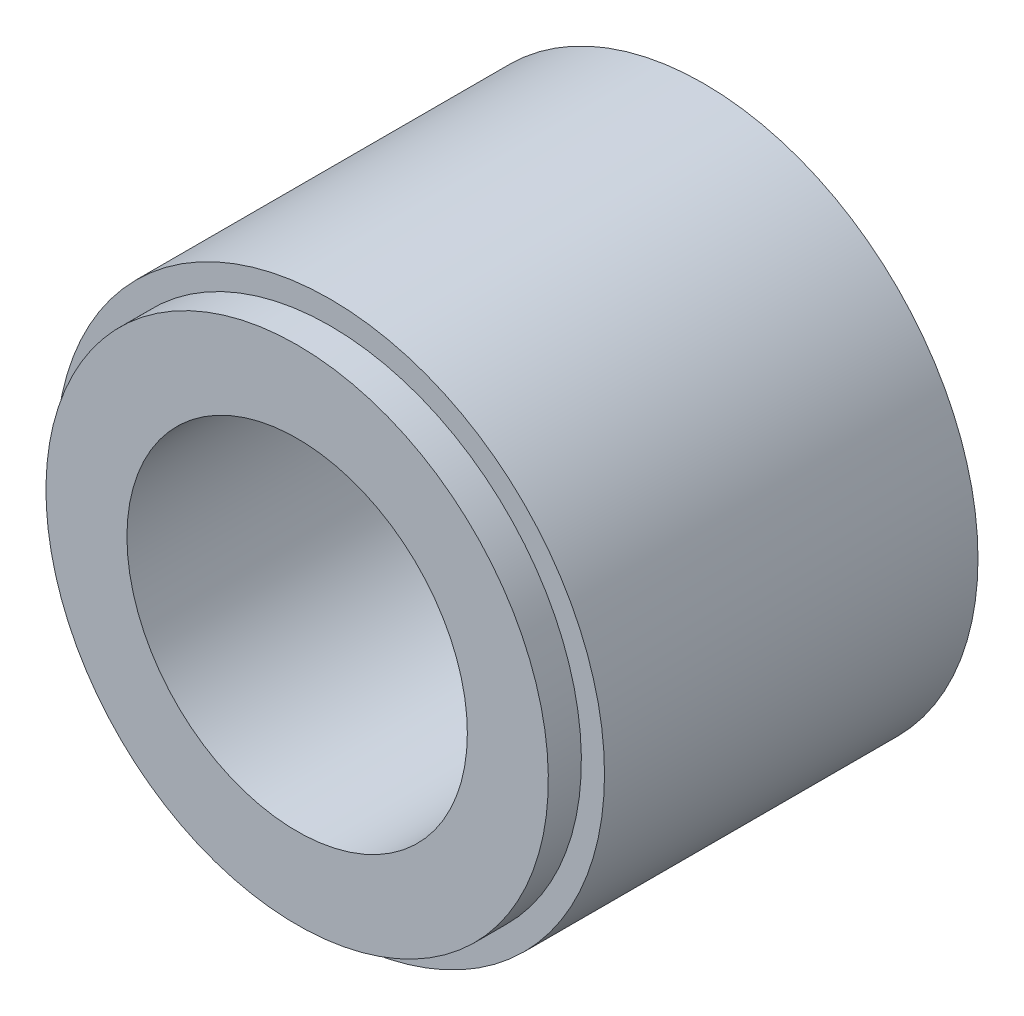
ISO-10303-21;
HEADER;
FILE_DESCRIPTION(('STEP AP214'),'2;1');
FILE_NAME('part.step','',(''),(''),'','','');
FILE_SCHEMA(('AUTOMOTIVE_DESIGN { 1 0 10303 214 1 1 1 1 }'));
ENDSEC;
DATA;
#1=APPLICATION_CONTEXT('core data for automotive mechanical design processes');
#2=APPLICATION_PROTOCOL_DEFINITION('international standard','automotive_design',2000,#1);
#3=PRODUCT_CONTEXT('',#1,'mechanical');
#4=PRODUCT('Part','Part','',(#3));
#5=PRODUCT_RELATED_PRODUCT_CATEGORY('part','',(#4));
#6=PRODUCT_DEFINITION_FORMATION('','',#4);
#7=PRODUCT_DEFINITION_CONTEXT('part definition',#1,'design');
#8=PRODUCT_DEFINITION('design','',#6,#7);
#9=PRODUCT_DEFINITION_SHAPE('','',#8);
#10=(LENGTH_UNIT() NAMED_UNIT(*) SI_UNIT(.MILLI.,.METRE.));
#11=(NAMED_UNIT(*) PLANE_ANGLE_UNIT() SI_UNIT($,.RADIAN.));
#12=(NAMED_UNIT(*) SI_UNIT($,.STERADIAN.) SOLID_ANGLE_UNIT());
#13=UNCERTAINTY_MEASURE_WITH_UNIT(LENGTH_MEASURE(1.E-05),#10,'distance_accuracy_value','');
#14=(GEOMETRIC_REPRESENTATION_CONTEXT(3) GLOBAL_UNCERTAINTY_ASSIGNED_CONTEXT((#13)) GLOBAL_UNIT_ASSIGNED_CONTEXT((#10,
#11,#12)) REPRESENTATION_CONTEXT('',''));
#15=CARTESIAN_POINT('',(0.,0.,0.));
#16=DIRECTION('',(0.,0.,1.));
#17=DIRECTION('',(1.,0.,0.));
#18=AXIS2_PLACEMENT_3D('',#15,#16,#17);
#19=CARTESIAN_POINT('',(39.8999974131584,39.8999974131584,61.5));
#20=DIRECTION('',(0.,0.,1.));
#21=DIRECTION('',(-1.,0.,0.));
#22=AXIS2_PLACEMENT_3D('',#19,#20,#21);
#23=PLANE('',#22);
#24=CARTESIAN_POINT('',(0.,0.,61.5));
#25=DIRECTION('',(0.,0.,-1.));
#26=DIRECTION('',(-1.,0.,0.));
#27=AXIS2_PLACEMENT_3D('',#24,#25,#26);
#28=CIRCLE('',#27,25.75);
#29=CARTESIAN_POINT('',(-25.75,0.,61.5));
#30=VERTEX_POINT('',#29);
#31=EDGE_CURVE('E9',#30,#30,#28,.T.);
#32=ORIENTED_EDGE('',*,*,#31,.T.);
#33=EDGE_LOOP('',(#32));
#34=FACE_BOUND('',#33,.T.);
#35=CARTESIAN_POINT('',(0.,0.,61.5));
#36=DIRECTION('',(0.,0.,-1.));
#37=DIRECTION('',(-1.,0.,0.));
#38=AXIS2_PLACEMENT_3D('',#35,#36,#37);
#39=CIRCLE('',#38,38.);
#40=CARTESIAN_POINT('',(0.,38.,61.5));
#41=VERTEX_POINT('',#40);
#42=EDGE_CURVE('E24',#41,#41,#39,.T.);
#43=ORIENTED_EDGE('',*,*,#42,.F.);
#44=EDGE_LOOP('',(#43));
#45=FACE_BOUND('',#44,.T.);
#46=ADVANCED_FACE('F14',(#34,#45),#23,.T.);
#47=CARTESIAN_POINT('',(0.,0.,56.5));
#48=DIRECTION('',(0.,0.,1.));
#49=DIRECTION('',(1.,0.,0.));
#50=AXIS2_PLACEMENT_3D('',#47,#48,#49);
#51=CYLINDRICAL_SURFACE('',#50,38.);
#52=CARTESIAN_POINT('',(0.,0.,56.5));
#53=DIRECTION('',(0.,0.,-1.));
#54=DIRECTION('',(-1.,0.,0.));
#55=AXIS2_PLACEMENT_3D('',#52,#53,#54);
#56=CIRCLE('',#55,38.);
#57=CARTESIAN_POINT('',(0.,38.,56.5));
#58=VERTEX_POINT('',#57);
#59=EDGE_CURVE('E58',#58,#58,#56,.T.);
#60=ORIENTED_EDGE('',*,*,#59,.F.);
#61=DIRECTION('',(0.,0.,-1.));
#62=VECTOR('',#61,1.);
#63=CARTESIAN_POINT('',(0.,38.,59.));
#64=LINE('',#63,#62);
#65=EDGE_CURVE('E61',#41,#58,#64,.T.);
#66=ORIENTED_EDGE('',*,*,#65,.F.);
#67=ORIENTED_EDGE('',*,*,#42,.T.);
#68=ORIENTED_EDGE('',*,*,#65,.T.);
#69=EDGE_LOOP('',(#60,#66,#67,#68));
#70=FACE_BOUND('',#69,.T.);
#71=ADVANCED_FACE('F67',(#70),#51,.T.);
#72=CARTESIAN_POINT('',(43.5749962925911,-43.5749962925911,56.5));
#73=DIRECTION('',(0.,0.,1.));
#74=DIRECTION('',(0.,1.,0.));
#75=AXIS2_PLACEMENT_3D('',#72,#73,#74);
#76=PLANE('',#75);
#77=ORIENTED_EDGE('',*,*,#59,.T.);
#78=EDGE_LOOP('',(#77));
#79=FACE_BOUND('',#78,.T.);
#80=CARTESIAN_POINT('',(0.,0.,56.5));
#81=DIRECTION('',(0.,0.,-1.));
#82=DIRECTION('',(-1.,0.,0.));
#83=AXIS2_PLACEMENT_3D('',#80,#81,#82);
#84=CIRCLE('',#83,41.5);
#85=CARTESIAN_POINT('',(41.5,0.,56.5));
#86=VERTEX_POINT('',#85);
#87=EDGE_CURVE('E52',#86,#86,#84,.T.);
#88=ORIENTED_EDGE('',*,*,#87,.F.);
#89=EDGE_LOOP('',(#88));
#90=FACE_BOUND('',#89,.T.);
#91=ADVANCED_FACE('F76',(#79,#90),#76,.T.);
#92=CARTESIAN_POINT('',(0.,0.,0.));
#93=DIRECTION('',(0.,0.,1.));
#94=DIRECTION('',(1.,0.,0.));
#95=AXIS2_PLACEMENT_3D('',#92,#93,#94);
#96=CYLINDRICAL_SURFACE('',#95,41.5);
#97=CARTESIAN_POINT('',(0.,0.,0.));
#98=DIRECTION('',(0.,0.,1.));
#99=DIRECTION('',(1.,0.,0.));
#100=AXIS2_PLACEMENT_3D('',#97,#98,#99);
#101=CIRCLE('',#100,41.5);
#102=CARTESIAN_POINT('',(41.5,0.,0.));
#103=VERTEX_POINT('',#102);
#104=EDGE_CURVE('E45',#103,#103,#101,.T.);
#105=ORIENTED_EDGE('',*,*,#104,.T.);
#106=DIRECTION('',(0.,0.,-1.));
#107=VECTOR('',#106,1.);
#108=CARTESIAN_POINT('',(41.5,0.,28.25));
#109=LINE('',#108,#107);
#110=EDGE_CURVE('E50',#86,#103,#109,.T.);
#111=ORIENTED_EDGE('',*,*,#110,.F.);
#112=ORIENTED_EDGE('',*,*,#87,.T.);
#113=ORIENTED_EDGE('',*,*,#110,.T.);
#114=EDGE_LOOP('',(#105,#111,#112,#113));
#115=FACE_BOUND('',#114,.T.);
#116=ADVANCED_FACE('F81',(#115),#96,.T.);
#117=CARTESIAN_POINT('',(-43.5749962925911,43.5749962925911,0.));
#118=DIRECTION('',(0.,0.,-1.));
#119=DIRECTION('',(1.,0.,0.));
#120=AXIS2_PLACEMENT_3D('',#117,#118,#119);
#121=PLANE('',#120);
#122=ORIENTED_EDGE('',*,*,#104,.F.);
#123=EDGE_LOOP('',(#122));
#124=FACE_BOUND('',#123,.T.);
#125=ADVANCED_FACE('F85',(#124),#121,.T.);
#126=CARTESIAN_POINT('',(0.,0.,61.5));
#127=DIRECTION('',(0.,0.,-1.));
#128=DIRECTION('',(-1.,0.,0.));
#129=AXIS2_PLACEMENT_3D('',#126,#127,#128);
#130=CYLINDRICAL_SURFACE('',#129,25.75);
#131=ORIENTED_EDGE('',*,*,#31,.F.);
#132=DIRECTION('',(0.,0.,-1.));
#133=VECTOR('',#132,1.);
#134=CARTESIAN_POINT('',(-25.75,0.,34.75));
#135=LINE('',#134,#133);
#136=CARTESIAN_POINT('',(-25.75,0.,8.));
#137=VERTEX_POINT('',#136);
#138=EDGE_CURVE('E33',#30,#137,#135,.T.);
#139=ORIENTED_EDGE('',*,*,#138,.T.);
#140=CARTESIAN_POINT('',(0.,0.,8.));
#141=DIRECTION('',(0.,0.,1.));
#142=DIRECTION('',(0.,-1.,0.));
#143=AXIS2_PLACEMENT_3D('',#140,#141,#142);
#144=CIRCLE('',#143,25.75);
#145=EDGE_CURVE('E18',#137,#137,#144,.T.);
#146=ORIENTED_EDGE('',*,*,#145,.F.);
#147=ORIENTED_EDGE('',*,*,#138,.F.);
#148=EDGE_LOOP('',(#131,#139,#146,#147));
#149=FACE_BOUND('',#148,.T.);
#150=ADVANCED_FACE('F48',(#149),#130,.F.);
#151=CARTESIAN_POINT('',(27.0374994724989,-27.0374994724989,8.));
#152=DIRECTION('',(0.,0.,1.));
#153=DIRECTION('',(0.,1.,0.));
#154=AXIS2_PLACEMENT_3D('',#151,#152,#153);
#155=PLANE('',#154);
#156=ORIENTED_EDGE('',*,*,#145,.T.);
#157=EDGE_LOOP('',(#156));
#158=FACE_BOUND('',#157,.T.);
#159=ADVANCED_FACE('F16',(#158),#155,.T.);
#160=CLOSED_SHELL('',(#46,#71,#91,#116,#125,#150,#159));
#161=MANIFOLD_SOLID_BREP('B1',#160);
#162=ADVANCED_BREP_SHAPE_REPRESENTATION('',(#18,#161),#14);
#163=SHAPE_DEFINITION_REPRESENTATION(#9,#162);
ENDSEC;
END-ISO-10303-21;
